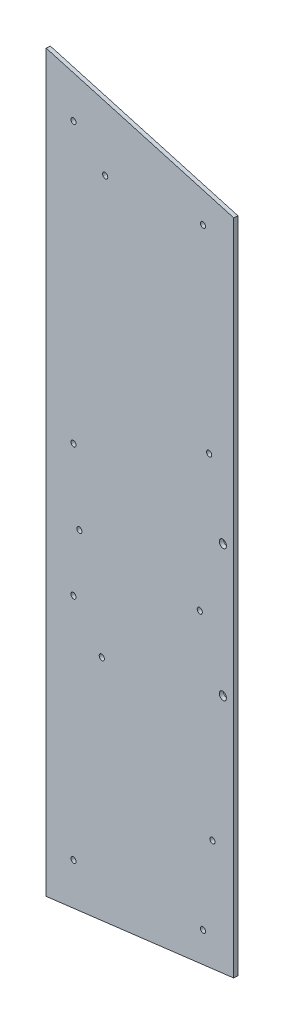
ISO-10303-21;
HEADER;
FILE_DESCRIPTION(('STEP AP214'),'2;1');
FILE_NAME('part.step','',(''),(''),'','','');
FILE_SCHEMA(('AUTOMOTIVE_DESIGN { 1 0 10303 214 1 1 1 1 }'));
ENDSEC;
DATA;
#1=APPLICATION_CONTEXT('core data for automotive mechanical design processes');
#2=APPLICATION_PROTOCOL_DEFINITION('international standard','automotive_design',2000,#1);
#3=PRODUCT_CONTEXT('',#1,'mechanical');
#4=PRODUCT('Part','Part','',(#3));
#5=PRODUCT_RELATED_PRODUCT_CATEGORY('part','',(#4));
#6=PRODUCT_DEFINITION_FORMATION('','',#4);
#7=PRODUCT_DEFINITION_CONTEXT('part definition',#1,'design');
#8=PRODUCT_DEFINITION('design','',#6,#7);
#9=PRODUCT_DEFINITION_SHAPE('','',#8);
#10=(LENGTH_UNIT() NAMED_UNIT(*) SI_UNIT(.MILLI.,.METRE.));
#11=(NAMED_UNIT(*) PLANE_ANGLE_UNIT() SI_UNIT($,.RADIAN.));
#12=(NAMED_UNIT(*) SI_UNIT($,.STERADIAN.) SOLID_ANGLE_UNIT());
#13=UNCERTAINTY_MEASURE_WITH_UNIT(LENGTH_MEASURE(1.E-05),#10,'distance_accuracy_value','');
#14=(GEOMETRIC_REPRESENTATION_CONTEXT(3) GLOBAL_UNCERTAINTY_ASSIGNED_CONTEXT((#13)) GLOBAL_UNIT_ASSIGNED_CONTEXT((#10,
#11,#12)) REPRESENTATION_CONTEXT('',''));
#15=CARTESIAN_POINT('',(0.,0.,0.));
#16=DIRECTION('',(0.,0.,1.));
#17=DIRECTION('',(1.,0.,0.));
#18=AXIS2_PLACEMENT_3D('',#15,#16,#17);
#19=CARTESIAN_POINT('',(185.325599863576,-298.45,-15.8314114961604));
#20=DIRECTION('',(-0.183879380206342,0.982853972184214,-0.0136544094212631));
#21=DIRECTION('',(-0.982945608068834,-0.183896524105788,0.));
#22=AXIS2_PLACEMENT_3D('',#19,#20,#21);
#23=PLANE('',#22);
#24=DIRECTION('',(-0.980155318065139,-0.184385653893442,-0.0727838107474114));
#25=VECTOR('',#24,1.);
#26=CARTESIAN_POINT('',(185.325599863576,-298.45,-15.8314114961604));
#27=LINE('',#26,#25);
#28=CARTESIAN_POINT('',(349.972279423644,-267.476862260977,-3.60517291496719));
#29=VERTEX_POINT('',#28);
#30=CARTESIAN_POINT('',(185.325599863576,-298.45,-15.8314114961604));
#31=VERTEX_POINT('',#30);
#32=EDGE_CURVE('E94',#29,#31,#27,.T.);
#33=ORIENTED_EDGE('',*,*,#32,.F.);
#34=DIRECTION('',(-0.0740535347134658,0.,0.99725426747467));
#35=VECTOR('',#34,1.);
#36=CARTESIAN_POINT('',(353.489395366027,-267.476862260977,-50.9690009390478));
#37=LINE('',#36,#35);
#38=CARTESIAN_POINT('',(349.737159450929,-267.476862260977,-0.438890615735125));
#39=VERTEX_POINT('',#38);
#40=EDGE_CURVE('E173',#29,#39,#37,.T.);
#41=ORIENTED_EDGE('',*,*,#40,.T.);
#42=DIRECTION('',(-0.980155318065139,-0.184385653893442,-0.0727838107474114));
#43=VECTOR('',#42,1.);
#44=CARTESIAN_POINT('',(185.090479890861,-298.45,-12.6651291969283));
#45=LINE('',#44,#43);
#46=CARTESIAN_POINT('',(185.090479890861,-298.45,-12.6651291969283));
#47=VERTEX_POINT('',#46);
#48=EDGE_CURVE('E85',#39,#47,#45,.T.);
#49=ORIENTED_EDGE('',*,*,#48,.T.);
#50=DIRECTION('',(-0.0740535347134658,0.,0.99725426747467));
#51=VECTOR('',#50,1.);
#52=CARTESIAN_POINT('',(185.325599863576,-298.45,-15.8314114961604));
#53=LINE('',#52,#51);
#54=EDGE_CURVE('E11',#31,#47,#53,.T.);
#55=ORIENTED_EDGE('',*,*,#54,.F.);
#56=EDGE_LOOP('',(#33,#41,#49,#55));
#57=FACE_BOUND('',#56,.T.);
#58=ADVANCED_FACE('F39',(#57),#23,.F.);
#59=CARTESIAN_POINT('',(185.325599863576,-298.45,-15.8314114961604));
#60=DIRECTION('',(0.99725426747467,0.,0.0740535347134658));
#61=DIRECTION('',(0.0740535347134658,0.,-0.99725426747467));
#62=AXIS2_PLACEMENT_3D('',#59,#60,#61);
#63=PLANE('',#62);
#64=DIRECTION('',(0.,1.,0.));
#65=VECTOR('',#64,1.);
#66=CARTESIAN_POINT('',(185.090479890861,-298.45,-12.6651291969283));
#67=LINE('',#66,#65);
#68=CARTESIAN_POINT('',(185.090479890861,298.45,-12.6651291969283));
#69=VERTEX_POINT('',#68);
#70=EDGE_CURVE('E76',#47,#69,#67,.T.);
#71=ORIENTED_EDGE('',*,*,#70,.T.);
#72=DIRECTION('',(-0.0740535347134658,0.,0.99725426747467));
#73=VECTOR('',#72,1.);
#74=CARTESIAN_POINT('',(185.325599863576,298.45,-15.8314114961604));
#75=LINE('',#74,#73);
#76=CARTESIAN_POINT('',(185.325599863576,298.45,-15.8314114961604));
#77=VERTEX_POINT('',#76);
#78=EDGE_CURVE('E47',#77,#69,#75,.T.);
#79=ORIENTED_EDGE('',*,*,#78,.F.);
#80=DIRECTION('',(0.,1.,0.));
#81=VECTOR('',#80,1.);
#82=CARTESIAN_POINT('',(185.325599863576,-298.45,-15.8314114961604));
#83=LINE('',#82,#81);
#84=EDGE_CURVE('E64',#31,#77,#83,.T.);
#85=ORIENTED_EDGE('',*,*,#84,.F.);
#86=ORIENTED_EDGE('',*,*,#54,.T.);
#87=EDGE_LOOP('',(#71,#79,#85,#86));
#88=FACE_BOUND('',#87,.T.);
#89=ADVANCED_FACE('F78',(#88),#63,.F.);
#90=CARTESIAN_POINT('',(826.675599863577,177.8,31.7935885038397));
#91=DIRECTION('',(-0.183879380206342,-0.982853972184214,-0.0136544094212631));
#92=DIRECTION('',(0.982945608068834,-0.183896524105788,0.));
#93=AXIS2_PLACEMENT_3D('',#90,#91,#92);
#94=PLANE('',#93);
#95=DIRECTION('',(0.980155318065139,-0.184385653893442,0.0727838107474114));
#96=VECTOR('',#95,1.);
#97=CARTESIAN_POINT('',(826.440479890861,177.8,34.9598708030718));
#98=LINE('',#97,#96);
#99=CARTESIAN_POINT('',(349.737159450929,267.476862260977,-0.438890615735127));
#100=VERTEX_POINT('',#99);
#101=EDGE_CURVE('E84',#69,#100,#98,.T.);
#102=ORIENTED_EDGE('',*,*,#101,.T.);
#103=DIRECTION('',(-0.0740535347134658,0.,0.99725426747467));
#104=VECTOR('',#103,1.);
#105=CARTESIAN_POINT('',(353.489395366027,267.476862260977,-50.9690009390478));
#106=LINE('',#105,#104);
#107=CARTESIAN_POINT('',(349.972279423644,267.476862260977,-3.60517291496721));
#108=VERTEX_POINT('',#107);
#109=EDGE_CURVE('E55',#108,#100,#106,.T.);
#110=ORIENTED_EDGE('',*,*,#109,.F.);
#111=DIRECTION('',(0.980155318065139,-0.184385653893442,0.0727838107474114));
#112=VECTOR('',#111,1.);
#113=CARTESIAN_POINT('',(826.675599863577,177.8,31.7935885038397));
#114=LINE('',#113,#112);
#115=EDGE_CURVE('E90',#77,#108,#114,.T.);
#116=ORIENTED_EDGE('',*,*,#115,.F.);
#117=ORIENTED_EDGE('',*,*,#78,.T.);
#118=EDGE_LOOP('',(#102,#110,#116,#117));
#119=FACE_BOUND('',#118,.T.);
#120=ADVANCED_FACE('F89',(#119),#94,.F.);
#121=CARTESIAN_POINT('',(2.18546483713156,0.,-29.4309264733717));
#122=DIRECTION('',(-0.0740535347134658,0.,0.99725426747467));
#123=DIRECTION('',(0.997254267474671,0.,0.0740535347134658));
#124=AXIS2_PLACEMENT_3D('',#121,#122,#123);
#125=PLANE('',#124);
#126=CARTESIAN_POINT('',(340.473432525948,33.,-4.31053283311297));
#127=DIRECTION('',(-0.0740535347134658,0.,0.99725426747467));
#128=DIRECTION('',(0.997254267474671,0.,0.0740535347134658));
#129=AXIS2_PLACEMENT_3D('',#126,#127,#128);
#130=CIRCLE('',#129,3.17499999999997);
#131=CARTESIAN_POINT('',(343.63971482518,33.,-4.07541286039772));
#132=VERTEX_POINT('',#131);
#133=EDGE_CURVE('E383',#132,#132,#130,.T.);
#134=ORIENTED_EDGE('',*,*,#133,.T.);
#135=EDGE_LOOP('',(#134));
#136=FACE_BOUND('',#135,.T.);
#137=CARTESIAN_POINT('',(340.473432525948,-74.,-4.31053283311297));
#138=DIRECTION('',(-0.0740535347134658,0.,0.99725426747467));
#139=DIRECTION('',(0.997254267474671,0.,0.0740535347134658));
#140=AXIS2_PLACEMENT_3D('',#137,#138,#139);
#141=CIRCLE('',#140,3.17499999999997);
#142=CARTESIAN_POINT('',(343.63971482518,-74.,-4.07541286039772));
#143=VERTEX_POINT('',#142);
#144=EDGE_CURVE('E384',#143,#143,#141,.T.);
#145=ORIENTED_EDGE('',*,*,#144,.T.);
#146=EDGE_LOOP('',(#145));
#147=FACE_BOUND('',#146,.T.);
#148=CARTESIAN_POINT('',(323.021224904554,248.051870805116,-5.60648884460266));
#149=DIRECTION('',(0.0740535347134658,0.,-0.997254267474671));
#150=DIRECTION('',(-0.997254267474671,0.,-0.0740535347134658));
#151=AXIS2_PLACEMENT_3D('',#148,#149,#150);
#152=CIRCLE('',#151,2.24999999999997);
#153=CARTESIAN_POINT('',(320.777402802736,248.051870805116,-5.77310929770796));
#154=VERTEX_POINT('',#153);
#155=EDGE_CURVE('E150',#154,#154,#152,.T.);
#156=ORIENTED_EDGE('',*,*,#155,.F.);
#157=EDGE_LOOP('',(#156));
#158=FACE_BOUND('',#157,.T.);
#159=CARTESIAN_POINT('',(209.334496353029,260.,-14.0485726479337));
#160=DIRECTION('',(0.0740535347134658,0.,-0.997254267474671));
#161=DIRECTION('',(-0.997254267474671,0.,-0.0740535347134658));
#162=AXIS2_PLACEMENT_3D('',#159,#160,#161);
#163=CIRCLE('',#162,2.24999999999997);
#164=CARTESIAN_POINT('',(207.090674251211,260.,-14.215193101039));
#165=VERTEX_POINT('',#164);
#166=EDGE_CURVE('E140',#165,#165,#163,.T.);
#167=ORIENTED_EDGE('',*,*,#166,.F.);
#168=EDGE_LOOP('',(#167));
#169=FACE_BOUND('',#168,.T.);
#170=CARTESIAN_POINT('',(209.334496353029,33.,-14.0485726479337));
#171=DIRECTION('',(0.0740535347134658,0.,-0.997254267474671));
#172=DIRECTION('',(-0.997254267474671,0.,-0.0740535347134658));
#173=AXIS2_PLACEMENT_3D('',#170,#171,#172);
#174=CIRCLE('',#173,2.25);
#175=CARTESIAN_POINT('',(207.090674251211,33.,-14.215193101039));
#176=VERTEX_POINT('',#175);
#177=EDGE_CURVE('E137',#176,#176,#174,.T.);
#178=ORIENTED_EDGE('',*,*,#177,.F.);
#179=EDGE_LOOP('',(#178));
#180=FACE_BOUND('',#179,.T.);
#181=CARTESIAN_POINT('',(209.334496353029,-260.,-14.0485726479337));
#182=DIRECTION('',(0.0740535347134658,0.,-0.997254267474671));
#183=DIRECTION('',(-0.997254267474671,0.,-0.0740535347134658));
#184=AXIS2_PLACEMENT_3D('',#181,#182,#183);
#185=CIRCLE('',#184,2.24999999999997);
#186=CARTESIAN_POINT('',(207.090674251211,-260.,-14.215193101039));
#187=VERTEX_POINT('',#186);
#188=EDGE_CURVE('E134',#187,#187,#185,.T.);
#189=ORIENTED_EDGE('',*,*,#188,.F.);
#190=EDGE_LOOP('',(#189));
#191=FACE_BOUND('',#190,.T.);
#192=CARTESIAN_POINT('',(209.334496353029,-74.,-14.0485726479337));
#193=DIRECTION('',(0.0740535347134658,0.,-0.997254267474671));
#194=DIRECTION('',(-0.997254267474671,0.,-0.0740535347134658));
#195=AXIS2_PLACEMENT_3D('',#192,#193,#194);
#196=CIRCLE('',#195,2.25);
#197=CARTESIAN_POINT('',(207.090674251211,-74.,-14.215193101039));
#198=VERTEX_POINT('',#197);
#199=EDGE_CURVE('E130',#198,#198,#196,.T.);
#200=ORIENTED_EDGE('',*,*,#199,.F.);
#201=EDGE_LOOP('',(#200));
#202=FACE_BOUND('',#201,.T.);
#203=CARTESIAN_POINT('',(323.021224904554,-248.051870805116,-5.60648884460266));
#204=DIRECTION('',(0.0740535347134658,0.,-0.997254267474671));
#205=DIRECTION('',(-0.997254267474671,0.,-0.0740535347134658));
#206=AXIS2_PLACEMENT_3D('',#203,#204,#205);
#207=CIRCLE('',#206,2.25);
#208=CARTESIAN_POINT('',(320.777402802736,-248.051870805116,-5.77310929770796));
#209=VERTEX_POINT('',#208);
#210=EDGE_CURVE('E126',#209,#209,#207,.T.);
#211=ORIENTED_EDGE('',*,*,#210,.F.);
#212=EDGE_LOOP('',(#211));
#213=FACE_BOUND('',#212,.T.);
#214=CARTESIAN_POINT('',(331.286227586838,-180.725,-4.99275102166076));
#215=DIRECTION('',(0.0740535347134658,0.,-0.997254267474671));
#216=DIRECTION('',(-0.997254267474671,0.,-0.0740535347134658));
#217=AXIS2_PLACEMENT_3D('',#214,#215,#216);
#218=CIRCLE('',#217,2.25);
#219=CARTESIAN_POINT('',(329.04240548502,-180.725,-5.15937147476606));
#220=VERTEX_POINT('',#219);
#221=EDGE_CURVE('E122',#220,#220,#218,.T.);
#222=ORIENTED_EDGE('',*,*,#221,.F.);
#223=EDGE_LOOP('',(#222));
#224=FACE_BOUND('',#223,.T.);
#225=CARTESIAN_POINT('',(234.191058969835,-104.,-12.2027882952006));
#226=DIRECTION('',(0.0740535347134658,0.,-0.997254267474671));
#227=DIRECTION('',(-0.997254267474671,0.,-0.0740535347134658));
#228=AXIS2_PLACEMENT_3D('',#225,#226,#227);
#229=CIRCLE('',#228,2.25);
#230=CARTESIAN_POINT('',(231.947236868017,-104.,-12.3694087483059));
#231=VERTEX_POINT('',#230);
#232=EDGE_CURVE('E118',#231,#231,#229,.T.);
#233=ORIENTED_EDGE('',*,*,#232,.F.);
#234=EDGE_LOOP('',(#233));
#235=FACE_BOUND('',#234,.T.);
#236=CARTESIAN_POINT('',(320.204239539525,-25.,-5.81567092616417));
#237=DIRECTION('',(0.0740535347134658,0.,-0.997254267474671));
#238=DIRECTION('',(-0.997254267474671,0.,-0.0740535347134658));
#239=AXIS2_PLACEMENT_3D('',#236,#237,#238);
#240=CIRCLE('',#239,2.25);
#241=CARTESIAN_POINT('',(317.960417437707,-25.,-5.98229137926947));
#242=VERTEX_POINT('',#241);
#243=EDGE_CURVE('E114',#242,#242,#240,.T.);
#244=ORIENTED_EDGE('',*,*,#243,.F.);
#245=EDGE_LOOP('',(#244));
#246=FACE_BOUND('',#245,.T.);
#247=CARTESIAN_POINT('',(214.49528718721,-25.,-13.6653456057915));
#248=DIRECTION('',(0.0740535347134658,0.,-0.997254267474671));
#249=DIRECTION('',(-0.997254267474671,0.,-0.0740535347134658));
#250=AXIS2_PLACEMENT_3D('',#247,#248,#249);
#251=CIRCLE('',#250,2.25);
#252=CARTESIAN_POINT('',(212.251465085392,-25.,-13.8319660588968));
#253=VERTEX_POINT('',#252);
#254=EDGE_CURVE('E110',#253,#253,#251,.T.);
#255=ORIENTED_EDGE('',*,*,#254,.F.);
#256=EDGE_LOOP('',(#255));
#257=FACE_BOUND('',#256,.T.);
#258=CARTESIAN_POINT('',(237.182821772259,236.6,-11.9806276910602));
#259=DIRECTION('',(0.0740535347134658,0.,-0.997254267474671));
#260=DIRECTION('',(-0.997254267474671,0.,-0.0740535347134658));
#261=AXIS2_PLACEMENT_3D('',#258,#259,#260);
#262=CIRCLE('',#261,2.25);
#263=CARTESIAN_POINT('',(234.938999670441,236.6,-12.1472481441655));
#264=VERTEX_POINT('',#263);
#265=EDGE_CURVE('E106',#264,#264,#262,.T.);
#266=ORIENTED_EDGE('',*,*,#265,.F.);
#267=EDGE_LOOP('',(#266));
#268=FACE_BOUND('',#267,.T.);
#269=CARTESIAN_POINT('',(328.431587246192,90.,-5.20472926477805));
#270=DIRECTION('',(0.0740535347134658,0.,-0.997254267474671));
#271=DIRECTION('',(-0.997254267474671,0.,-0.0740535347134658));
#272=AXIS2_PLACEMENT_3D('',#269,#270,#271);
#273=CIRCLE('',#272,2.25);
#274=CARTESIAN_POINT('',(326.187765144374,90.,-5.37134971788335));
#275=VERTEX_POINT('',#274);
#276=EDGE_CURVE('E102',#275,#275,#273,.T.);
#277=ORIENTED_EDGE('',*,*,#276,.F.);
#278=EDGE_LOOP('',(#277));
#279=FACE_BOUND('',#278,.T.);
#280=ORIENTED_EDGE('',*,*,#115,.T.);
#281=DIRECTION('',(0.,-1.,0.));
#282=VECTOR('',#281,1.);
#283=CARTESIAN_POINT('',(349.972279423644,0.,-3.6051729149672));
#284=LINE('',#283,#282);
#285=EDGE_CURVE('E176',#108,#29,#284,.T.);
#286=ORIENTED_EDGE('',*,*,#285,.T.);
#287=ORIENTED_EDGE('',*,*,#32,.T.);
#288=ORIENTED_EDGE('',*,*,#84,.T.);
#289=EDGE_LOOP('',(#280,#286,#287,#288));
#290=FACE_BOUND('',#289,.T.);
#291=ADVANCED_FACE('F189',(#136,#147,#158,#169,#180,#191,#202,#213,#224,#235,#246,#257,#268,
#279,#290),#125,.F.);
#292=CARTESIAN_POINT('',(1.95034486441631,0.,-26.2646441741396));
#293=DIRECTION('',(-0.0740535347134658,0.,0.99725426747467));
#294=DIRECTION('',(0.997254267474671,0.,0.0740535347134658));
#295=AXIS2_PLACEMENT_3D('',#292,#293,#294);
#296=PLANE('',#295);
#297=CARTESIAN_POINT('',(340.238312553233,33.,-1.1442505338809));
#298=DIRECTION('',(-0.0740535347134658,0.,0.997254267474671));
#299=DIRECTION('',(0.997254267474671,0.,0.0740535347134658));
#300=AXIS2_PLACEMENT_3D('',#297,#298,#299);
#301=CIRCLE('',#300,3.17499999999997);
#302=CARTESIAN_POINT('',(343.404594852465,33.,-0.909130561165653));
#303=VERTEX_POINT('',#302);
#304=EDGE_CURVE('E381',#303,#303,#301,.T.);
#305=ORIENTED_EDGE('',*,*,#304,.F.);
#306=EDGE_LOOP('',(#305));
#307=FACE_BOUND('',#306,.T.);
#308=CARTESIAN_POINT('',(340.238312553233,-74.,-1.1442505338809));
#309=DIRECTION('',(-0.0740535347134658,0.,0.997254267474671));
#310=DIRECTION('',(0.997254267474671,0.,0.0740535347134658));
#311=AXIS2_PLACEMENT_3D('',#308,#309,#310);
#312=CIRCLE('',#311,3.17499999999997);
#313=CARTESIAN_POINT('',(343.404594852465,-74.,-0.909130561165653));
#314=VERTEX_POINT('',#313);
#315=EDGE_CURVE('E389',#314,#314,#312,.T.);
#316=ORIENTED_EDGE('',*,*,#315,.F.);
#317=EDGE_LOOP('',(#316));
#318=FACE_BOUND('',#317,.T.);
#319=CARTESIAN_POINT('',(322.786104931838,248.051870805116,-2.44020654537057));
#320=DIRECTION('',(-0.0740535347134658,0.,0.99725426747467));
#321=DIRECTION('',(0.997254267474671,0.,0.0740535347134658));
#322=AXIS2_PLACEMENT_3D('',#319,#320,#321);
#323=CIRCLE('',#322,2.24999999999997);
#324=CARTESIAN_POINT('',(325.029927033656,248.051870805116,-2.27358609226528));
#325=VERTEX_POINT('',#324);
#326=EDGE_CURVE('E42',#325,#325,#323,.T.);
#327=ORIENTED_EDGE('',*,*,#326,.F.);
#328=EDGE_LOOP('',(#327));
#329=FACE_BOUND('',#328,.T.);
#330=CARTESIAN_POINT('',(209.099376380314,260.,-10.8822903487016));
#331=DIRECTION('',(-0.0740535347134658,0.,0.99725426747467));
#332=DIRECTION('',(0.997254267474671,0.,0.0740535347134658));
#333=AXIS2_PLACEMENT_3D('',#330,#331,#332);
#334=CIRCLE('',#333,2.24999999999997);
#335=CARTESIAN_POINT('',(211.343198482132,260.,-10.7156698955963));
#336=VERTEX_POINT('',#335);
#337=EDGE_CURVE('E138',#336,#336,#334,.T.);
#338=ORIENTED_EDGE('',*,*,#337,.F.);
#339=EDGE_LOOP('',(#338));
#340=FACE_BOUND('',#339,.T.);
#341=CARTESIAN_POINT('',(209.099376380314,33.,-10.8822903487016));
#342=DIRECTION('',(-0.0740535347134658,0.,0.99725426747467));
#343=DIRECTION('',(0.997254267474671,0.,0.0740535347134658));
#344=AXIS2_PLACEMENT_3D('',#341,#342,#343);
#345=CIRCLE('',#344,2.25);
#346=CARTESIAN_POINT('',(211.343198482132,33.,-10.7156698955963));
#347=VERTEX_POINT('',#346);
#348=EDGE_CURVE('E135',#347,#347,#345,.T.);
#349=ORIENTED_EDGE('',*,*,#348,.F.);
#350=EDGE_LOOP('',(#349));
#351=FACE_BOUND('',#350,.T.);
#352=CARTESIAN_POINT('',(209.099376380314,-260.,-10.8822903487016));
#353=DIRECTION('',(-0.0740535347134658,0.,0.99725426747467));
#354=DIRECTION('',(0.997254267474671,0.,0.0740535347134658));
#355=AXIS2_PLACEMENT_3D('',#352,#353,#354);
#356=CIRCLE('',#355,2.24999999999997);
#357=CARTESIAN_POINT('',(211.343198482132,-260.,-10.7156698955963));
#358=VERTEX_POINT('',#357);
#359=EDGE_CURVE('E131',#358,#358,#356,.T.);
#360=ORIENTED_EDGE('',*,*,#359,.F.);
#361=EDGE_LOOP('',(#360));
#362=FACE_BOUND('',#361,.T.);
#363=CARTESIAN_POINT('',(209.099376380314,-74.,-10.8822903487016));
#364=DIRECTION('',(-0.0740535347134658,0.,0.99725426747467));
#365=DIRECTION('',(0.997254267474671,0.,0.0740535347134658));
#366=AXIS2_PLACEMENT_3D('',#363,#364,#365);
#367=CIRCLE('',#366,2.25);
#368=CARTESIAN_POINT('',(211.343198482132,-74.,-10.7156698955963));
#369=VERTEX_POINT('',#368);
#370=EDGE_CURVE('E127',#369,#369,#367,.T.);
#371=ORIENTED_EDGE('',*,*,#370,.F.);
#372=EDGE_LOOP('',(#371));
#373=FACE_BOUND('',#372,.T.);
#374=CARTESIAN_POINT('',(322.786104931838,-248.051870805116,-2.44020654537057));
#375=DIRECTION('',(-0.0740535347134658,0.,0.99725426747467));
#376=DIRECTION('',(0.997254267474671,0.,0.0740535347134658));
#377=AXIS2_PLACEMENT_3D('',#374,#375,#376);
#378=CIRCLE('',#377,2.25);
#379=CARTESIAN_POINT('',(325.029927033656,-248.051870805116,-2.27358609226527));
#380=VERTEX_POINT('',#379);
#381=EDGE_CURVE('E123',#380,#380,#378,.T.);
#382=ORIENTED_EDGE('',*,*,#381,.F.);
#383=EDGE_LOOP('',(#382));
#384=FACE_BOUND('',#383,.T.);
#385=CARTESIAN_POINT('',(331.051107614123,-180.725,-1.82646872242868));
#386=DIRECTION('',(-0.0740535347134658,0.,0.99725426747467));
#387=DIRECTION('',(0.997254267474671,0.,0.0740535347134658));
#388=AXIS2_PLACEMENT_3D('',#385,#386,#387);
#389=CIRCLE('',#388,2.25);
#390=CARTESIAN_POINT('',(333.294929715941,-180.725,-1.65984826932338));
#391=VERTEX_POINT('',#390);
#392=EDGE_CURVE('E119',#391,#391,#389,.T.);
#393=ORIENTED_EDGE('',*,*,#392,.F.);
#394=EDGE_LOOP('',(#393));
#395=FACE_BOUND('',#394,.T.);
#396=CARTESIAN_POINT('',(233.95593899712,-104.,-9.03650599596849));
#397=DIRECTION('',(-0.0740535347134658,0.,0.99725426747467));
#398=DIRECTION('',(0.997254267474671,0.,0.0740535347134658));
#399=AXIS2_PLACEMENT_3D('',#396,#397,#398);
#400=CIRCLE('',#399,2.25);
#401=CARTESIAN_POINT('',(236.199761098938,-104.,-8.86988554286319));
#402=VERTEX_POINT('',#401);
#403=EDGE_CURVE('E115',#402,#402,#400,.T.);
#404=ORIENTED_EDGE('',*,*,#403,.F.);
#405=EDGE_LOOP('',(#404));
#406=FACE_BOUND('',#405,.T.);
#407=CARTESIAN_POINT('',(319.96911956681,-25.,-2.64938862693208));
#408=DIRECTION('',(-0.0740535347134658,0.,0.99725426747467));
#409=DIRECTION('',(0.997254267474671,0.,0.0740535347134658));
#410=AXIS2_PLACEMENT_3D('',#407,#408,#409);
#411=CIRCLE('',#410,2.25);
#412=CARTESIAN_POINT('',(322.212941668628,-25.,-2.48276817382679));
#413=VERTEX_POINT('',#412);
#414=EDGE_CURVE('E111',#413,#413,#411,.T.);
#415=ORIENTED_EDGE('',*,*,#414,.F.);
#416=EDGE_LOOP('',(#415));
#417=FACE_BOUND('',#416,.T.);
#418=CARTESIAN_POINT('',(214.260167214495,-25.,-10.4990633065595));
#419=DIRECTION('',(-0.0740535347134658,0.,0.99725426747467));
#420=DIRECTION('',(0.997254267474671,0.,0.0740535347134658));
#421=AXIS2_PLACEMENT_3D('',#418,#419,#420);
#422=CIRCLE('',#421,2.25);
#423=CARTESIAN_POINT('',(216.503989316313,-25.,-10.3324428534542));
#424=VERTEX_POINT('',#423);
#425=EDGE_CURVE('E107',#424,#424,#422,.T.);
#426=ORIENTED_EDGE('',*,*,#425,.F.);
#427=EDGE_LOOP('',(#426));
#428=FACE_BOUND('',#427,.T.);
#429=CARTESIAN_POINT('',(236.947701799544,236.6,-8.81434539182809));
#430=DIRECTION('',(-0.0740535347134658,0.,0.99725426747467));
#431=DIRECTION('',(0.997254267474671,0.,0.0740535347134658));
#432=AXIS2_PLACEMENT_3D('',#429,#430,#431);
#433=CIRCLE('',#432,2.25);
#434=CARTESIAN_POINT('',(239.191523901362,236.6,-8.64772493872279));
#435=VERTEX_POINT('',#434);
#436=EDGE_CURVE('E103',#435,#435,#433,.T.);
#437=ORIENTED_EDGE('',*,*,#436,.F.);
#438=EDGE_LOOP('',(#437));
#439=FACE_BOUND('',#438,.T.);
#440=CARTESIAN_POINT('',(328.196467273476,90.,-2.03844696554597));
#441=DIRECTION('',(-0.0740535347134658,0.,0.99725426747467));
#442=DIRECTION('',(0.997254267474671,0.,0.0740535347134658));
#443=AXIS2_PLACEMENT_3D('',#440,#441,#442);
#444=CIRCLE('',#443,2.25);
#445=CARTESIAN_POINT('',(330.440289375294,90.,-1.87182651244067));
#446=VERTEX_POINT('',#445);
#447=EDGE_CURVE('E99',#446,#446,#444,.T.);
#448=ORIENTED_EDGE('',*,*,#447,.F.);
#449=EDGE_LOOP('',(#448));
#450=FACE_BOUND('',#449,.T.);
#451=DIRECTION('',(0.,-1.,0.));
#452=VECTOR('',#451,1.);
#453=CARTESIAN_POINT('',(349.737159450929,0.,-0.438890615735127));
#454=LINE('',#453,#452);
#455=EDGE_CURVE('E93',#100,#39,#454,.T.);
#456=ORIENTED_EDGE('',*,*,#455,.F.);
#457=ORIENTED_EDGE('',*,*,#101,.F.);
#458=ORIENTED_EDGE('',*,*,#70,.F.);
#459=ORIENTED_EDGE('',*,*,#48,.F.);
#460=EDGE_LOOP('',(#456,#457,#458,#459));
#461=FACE_BOUND('',#460,.T.);
#462=ADVANCED_FACE('F92',(#307,#318,#329,#340,#351,#362,#373,#384,#395,#406,#417,#428,#439,#450,
#461),#296,.T.);
#463=CARTESIAN_POINT('',(353.489395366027,0.,-50.9690009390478));
#464=DIRECTION('',(-0.99725426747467,0.,-0.0740535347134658));
#465=DIRECTION('',(-0.0740535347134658,0.,0.99725426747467));
#466=AXIS2_PLACEMENT_3D('',#463,#464,#465);
#467=PLANE('',#466);
#468=ORIENTED_EDGE('',*,*,#109,.T.);
#469=ORIENTED_EDGE('',*,*,#455,.T.);
#470=ORIENTED_EDGE('',*,*,#40,.F.);
#471=ORIENTED_EDGE('',*,*,#285,.F.);
#472=EDGE_LOOP('',(#468,#469,#470,#471));
#473=FACE_BOUND('',#472,.T.);
#474=ADVANCED_FACE('F188',(#473),#467,.F.);
#475=CARTESIAN_POINT('',(328.431587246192,90.,-5.20472926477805));
#476=DIRECTION('',(0.0740535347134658,0.,-0.997254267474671));
#477=DIRECTION('',(-0.997254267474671,0.,-0.0740535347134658));
#478=AXIS2_PLACEMENT_3D('',#475,#476,#477);
#479=CYLINDRICAL_SURFACE('',#478,2.25);
#480=ORIENTED_EDGE('',*,*,#447,.T.);
#481=EDGE_LOOP('',(#480));
#482=FACE_BOUND('',#481,.T.);
#483=ORIENTED_EDGE('',*,*,#276,.T.);
#484=EDGE_LOOP('',(#483));
#485=FACE_BOUND('',#484,.T.);
#486=ADVANCED_FACE('F240',(#482,#485),#479,.F.);
#487=CARTESIAN_POINT('',(237.182821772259,236.6,-11.9806276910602));
#488=DIRECTION('',(0.0740535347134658,0.,-0.997254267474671));
#489=DIRECTION('',(-0.997254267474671,0.,-0.0740535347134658));
#490=AXIS2_PLACEMENT_3D('',#487,#488,#489);
#491=CYLINDRICAL_SURFACE('',#490,2.25);
#492=ORIENTED_EDGE('',*,*,#436,.T.);
#493=EDGE_LOOP('',(#492));
#494=FACE_BOUND('',#493,.T.);
#495=ORIENTED_EDGE('',*,*,#265,.T.);
#496=EDGE_LOOP('',(#495));
#497=FACE_BOUND('',#496,.T.);
#498=ADVANCED_FACE('F248',(#494,#497),#491,.F.);
#499=CARTESIAN_POINT('',(214.49528718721,-25.,-13.6653456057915));
#500=DIRECTION('',(0.0740535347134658,0.,-0.997254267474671));
#501=DIRECTION('',(-0.997254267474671,0.,-0.0740535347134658));
#502=AXIS2_PLACEMENT_3D('',#499,#500,#501);
#503=CYLINDRICAL_SURFACE('',#502,2.25);
#504=ORIENTED_EDGE('',*,*,#425,.T.);
#505=EDGE_LOOP('',(#504));
#506=FACE_BOUND('',#505,.T.);
#507=ORIENTED_EDGE('',*,*,#254,.T.);
#508=EDGE_LOOP('',(#507));
#509=FACE_BOUND('',#508,.T.);
#510=ADVANCED_FACE('F258',(#506,#509),#503,.F.);
#511=CARTESIAN_POINT('',(320.204239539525,-25.,-5.81567092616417));
#512=DIRECTION('',(0.0740535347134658,0.,-0.997254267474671));
#513=DIRECTION('',(-0.997254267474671,0.,-0.0740535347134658));
#514=AXIS2_PLACEMENT_3D('',#511,#512,#513);
#515=CYLINDRICAL_SURFACE('',#514,2.25);
#516=ORIENTED_EDGE('',*,*,#414,.T.);
#517=EDGE_LOOP('',(#516));
#518=FACE_BOUND('',#517,.T.);
#519=ORIENTED_EDGE('',*,*,#243,.T.);
#520=EDGE_LOOP('',(#519));
#521=FACE_BOUND('',#520,.T.);
#522=ADVANCED_FACE('F268',(#518,#521),#515,.F.);
#523=CARTESIAN_POINT('',(234.191058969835,-104.,-12.2027882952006));
#524=DIRECTION('',(0.0740535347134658,0.,-0.997254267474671));
#525=DIRECTION('',(-0.997254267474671,0.,-0.0740535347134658));
#526=AXIS2_PLACEMENT_3D('',#523,#524,#525);
#527=CYLINDRICAL_SURFACE('',#526,2.25);
#528=ORIENTED_EDGE('',*,*,#403,.T.);
#529=EDGE_LOOP('',(#528));
#530=FACE_BOUND('',#529,.T.);
#531=ORIENTED_EDGE('',*,*,#232,.T.);
#532=EDGE_LOOP('',(#531));
#533=FACE_BOUND('',#532,.T.);
#534=ADVANCED_FACE('F278',(#530,#533),#527,.F.);
#535=CARTESIAN_POINT('',(331.286227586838,-180.725,-4.99275102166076));
#536=DIRECTION('',(0.0740535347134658,0.,-0.997254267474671));
#537=DIRECTION('',(-0.997254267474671,0.,-0.0740535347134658));
#538=AXIS2_PLACEMENT_3D('',#535,#536,#537);
#539=CYLINDRICAL_SURFACE('',#538,2.25);
#540=ORIENTED_EDGE('',*,*,#392,.T.);
#541=EDGE_LOOP('',(#540));
#542=FACE_BOUND('',#541,.T.);
#543=ORIENTED_EDGE('',*,*,#221,.T.);
#544=EDGE_LOOP('',(#543));
#545=FACE_BOUND('',#544,.T.);
#546=ADVANCED_FACE('F288',(#542,#545),#539,.F.);
#547=CARTESIAN_POINT('',(323.021224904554,-248.051870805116,-5.60648884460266));
#548=DIRECTION('',(0.0740535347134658,0.,-0.997254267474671));
#549=DIRECTION('',(-0.997254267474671,0.,-0.0740535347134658));
#550=AXIS2_PLACEMENT_3D('',#547,#548,#549);
#551=CYLINDRICAL_SURFACE('',#550,2.25);
#552=ORIENTED_EDGE('',*,*,#381,.T.);
#553=EDGE_LOOP('',(#552));
#554=FACE_BOUND('',#553,.T.);
#555=ORIENTED_EDGE('',*,*,#210,.T.);
#556=EDGE_LOOP('',(#555));
#557=FACE_BOUND('',#556,.T.);
#558=ADVANCED_FACE('F298',(#554,#557),#551,.F.);
#559=CARTESIAN_POINT('',(209.334496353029,-74.,-14.0485726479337));
#560=DIRECTION('',(0.0740535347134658,0.,-0.997254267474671));
#561=DIRECTION('',(-0.997254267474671,0.,-0.0740535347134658));
#562=AXIS2_PLACEMENT_3D('',#559,#560,#561);
#563=CYLINDRICAL_SURFACE('',#562,2.25);
#564=ORIENTED_EDGE('',*,*,#370,.T.);
#565=EDGE_LOOP('',(#564));
#566=FACE_BOUND('',#565,.T.);
#567=ORIENTED_EDGE('',*,*,#199,.T.);
#568=EDGE_LOOP('',(#567));
#569=FACE_BOUND('',#568,.T.);
#570=ADVANCED_FACE('F308',(#566,#569),#563,.F.);
#571=CARTESIAN_POINT('',(209.334496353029,-260.,-14.0485726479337));
#572=DIRECTION('',(0.0740535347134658,0.,-0.997254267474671));
#573=DIRECTION('',(-0.997254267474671,0.,-0.0740535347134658));
#574=AXIS2_PLACEMENT_3D('',#571,#572,#573);
#575=CYLINDRICAL_SURFACE('',#574,2.24999999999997);
#576=ORIENTED_EDGE('',*,*,#359,.T.);
#577=EDGE_LOOP('',(#576));
#578=FACE_BOUND('',#577,.T.);
#579=ORIENTED_EDGE('',*,*,#188,.T.);
#580=EDGE_LOOP('',(#579));
#581=FACE_BOUND('',#580,.T.);
#582=ADVANCED_FACE('F318',(#578,#581),#575,.F.);
#583=CARTESIAN_POINT('',(209.334496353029,33.,-14.0485726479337));
#584=DIRECTION('',(0.0740535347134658,0.,-0.997254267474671));
#585=DIRECTION('',(-0.997254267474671,0.,-0.0740535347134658));
#586=AXIS2_PLACEMENT_3D('',#583,#584,#585);
#587=CYLINDRICAL_SURFACE('',#586,2.25);
#588=ORIENTED_EDGE('',*,*,#348,.T.);
#589=EDGE_LOOP('',(#588));
#590=FACE_BOUND('',#589,.T.);
#591=ORIENTED_EDGE('',*,*,#177,.T.);
#592=EDGE_LOOP('',(#591));
#593=FACE_BOUND('',#592,.T.);
#594=ADVANCED_FACE('F328',(#590,#593),#587,.F.);
#595=CARTESIAN_POINT('',(209.334496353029,260.,-14.0485726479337));
#596=DIRECTION('',(0.0740535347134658,0.,-0.997254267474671));
#597=DIRECTION('',(-0.997254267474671,0.,-0.0740535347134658));
#598=AXIS2_PLACEMENT_3D('',#595,#596,#597);
#599=CYLINDRICAL_SURFACE('',#598,2.24999999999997);
#600=ORIENTED_EDGE('',*,*,#337,.T.);
#601=EDGE_LOOP('',(#600));
#602=FACE_BOUND('',#601,.T.);
#603=ORIENTED_EDGE('',*,*,#166,.T.);
#604=EDGE_LOOP('',(#603));
#605=FACE_BOUND('',#604,.T.);
#606=ADVANCED_FACE('F338',(#602,#605),#599,.F.);
#607=CARTESIAN_POINT('',(323.021224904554,248.051870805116,-5.60648884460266));
#608=DIRECTION('',(0.0740535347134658,0.,-0.997254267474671));
#609=DIRECTION('',(-0.997254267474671,0.,-0.0740535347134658));
#610=AXIS2_PLACEMENT_3D('',#607,#608,#609);
#611=CYLINDRICAL_SURFACE('',#610,2.24999999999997);
#612=ORIENTED_EDGE('',*,*,#326,.T.);
#613=EDGE_LOOP('',(#612));
#614=FACE_BOUND('',#613,.T.);
#615=ORIENTED_EDGE('',*,*,#155,.T.);
#616=EDGE_LOOP('',(#615));
#617=FACE_BOUND('',#616,.T.);
#618=ADVANCED_FACE('F348',(#614,#617),#611,.F.);
#619=CARTESIAN_POINT('',(341.376342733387,-74.,-16.4697236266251));
#620=DIRECTION('',(-0.0740535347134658,0.,0.99725426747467));
#621=DIRECTION('',(0.99725426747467,0.,0.0740535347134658));
#622=AXIS2_PLACEMENT_3D('',#619,#620,#621);
#623=CYLINDRICAL_SURFACE('',#622,3.17499999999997);
#624=ORIENTED_EDGE('',*,*,#315,.T.);
#625=EDGE_LOOP('',(#624));
#626=FACE_BOUND('',#625,.T.);
#627=ORIENTED_EDGE('',*,*,#144,.F.);
#628=EDGE_LOOP('',(#627));
#629=FACE_BOUND('',#628,.T.);
#630=ADVANCED_FACE('F356',(#626,#629),#623,.F.);
#631=CARTESIAN_POINT('',(341.376342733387,33.,-16.4697236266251));
#632=DIRECTION('',(-0.0740535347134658,0.,0.99725426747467));
#633=DIRECTION('',(0.99725426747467,0.,0.0740535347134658));
#634=AXIS2_PLACEMENT_3D('',#631,#632,#633);
#635=CYLINDRICAL_SURFACE('',#634,3.17499999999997);
#636=ORIENTED_EDGE('',*,*,#304,.T.);
#637=EDGE_LOOP('',(#636));
#638=FACE_BOUND('',#637,.T.);
#639=ORIENTED_EDGE('',*,*,#133,.F.);
#640=EDGE_LOOP('',(#639));
#641=FACE_BOUND('',#640,.T.);
#642=ADVANCED_FACE('F365',(#638,#641),#635,.F.);
#643=CLOSED_SHELL('',(#58,#89,#120,#291,#462,#474,#486,#498,#510,#522,#534,#546,#558,#570,#582,
#594,#606,#618,#630,#642));
#644=MANIFOLD_SOLID_BREP('B2',#643);
#645=ADVANCED_BREP_SHAPE_REPRESENTATION('',(#18,#644),#14);
#646=SHAPE_DEFINITION_REPRESENTATION(#9,#645);
ENDSEC;
END-ISO-10303-21;
